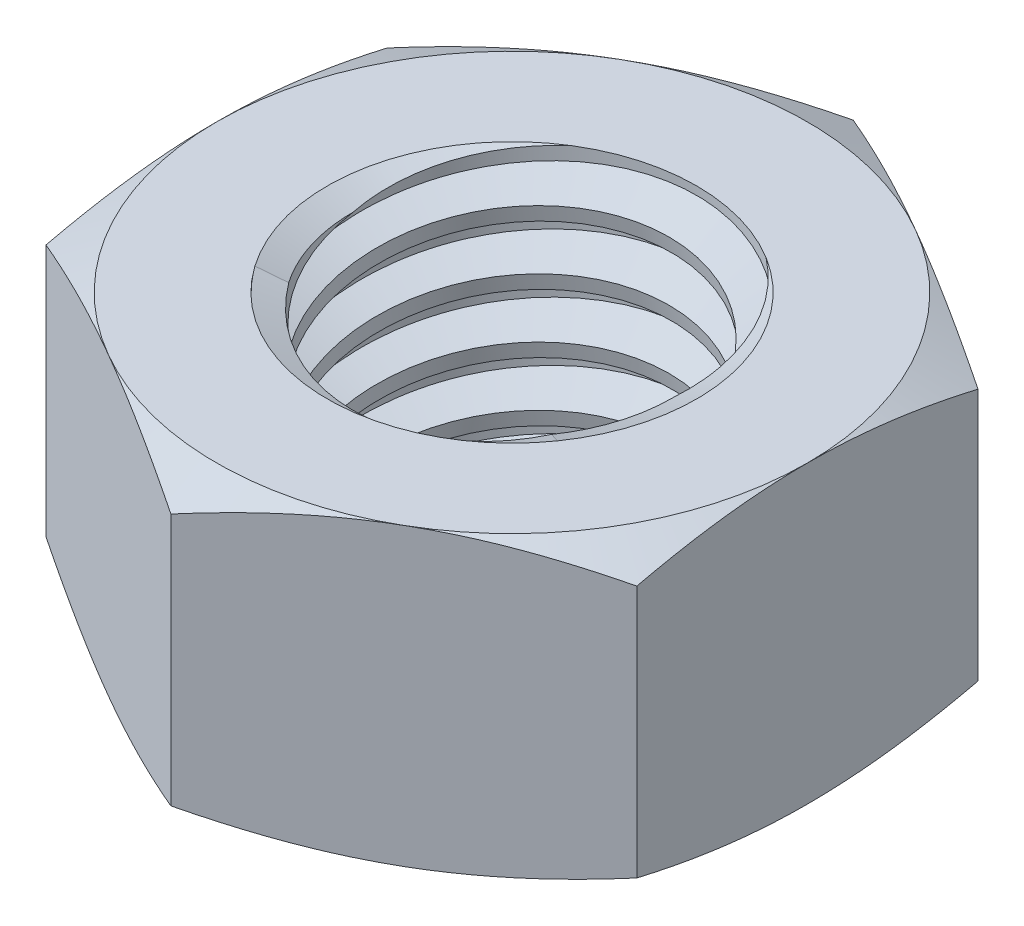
from build123d import *

# Parameters (mm, degrees)
EXTRUDE1_DEPTH      = 2
SKETCH2_W           = 2.5
SKETCH2_H           = 4
LPATTERN1_COUNT     = 5
LPATTERN1_PITCH     = 0.8
LPATTERN1_COL_COUNT = 2
LPATTERN1_COL_PITCH = 0.8


with BuildPart() as part:
    # Sketch1 → Extrude1 (new, symmetric)
    with BuildSketch(Plane(origin=(0, 0, 0), x_dir=(1, 0, 0), z_dir=(0, 1, 0))):
        Polygon((0, 4.618802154), (-4, 2.309401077), (-4, -2.309401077), (0, -4.618802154), (4, -2.309401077), (4, 2.309401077), align=None)
    extrude(amount=EXTRUDE1_DEPTH, both=True)

    # Sketch4 → Cut-Revolve2 (revolve, cut)
    with BuildSketch(Plane(origin=(0, 0, 0), x_dir=(0, 0, -1), z_dir=(1, 0, 0))):
        Polygon((0, 2), (2.5, 2), (2.127722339, 1.826404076), (2.127722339, -1.826404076), (2.5, -2), (0, -2), align=None)
    revolve(axis=Axis((0, 2, 0), (0, 1, 0)), mode=Mode.SUBTRACT)


with BuildPart() as body_2:
    # Sketch2 → Revolve1 (revolve)
    with BuildSketch(Plane(origin=(0, 0, 0), x_dir=(0, 0, -1), z_dir=(1, 0, 0))):
        with Locations((1.25, 0)):
            Rectangle(SKETCH2_W, SKETCH2_H)
    revolve(axis=Axis((0, -4.5, 0), (0, 1, 0)))

    # Sketch3 → Cut-Revolve1 (revolve, cut)
    with BuildSketch(Plane(origin=(0, 0, 0), x_dir=(0, 0, -1), z_dir=(1, 0, 0)), mode=Mode.PRIVATE) as cut_revolve1_sk:
        Polygon((2.51579905, 1.901255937), (2.626392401, 1.210047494), (2.15932044, 1.388495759), (2.127722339, 1.585983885), align=None)
    cut_revolve1 = revolve(cut_revolve1_sk.sketch.rotate(Axis((0, 2, 0.136915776), (0, -0.9874406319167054, -0.15799050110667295)), 180), axis=Axis((0, 2, 0.136915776), (0, -0.9874406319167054, -0.15799050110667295)), mode=Mode.SUBTRACT)

    # LPattern1: Cut-Revolve1 ×5
    with Locations(*[(0, -i * LPATTERN1_PITCH, 0) for i in range(1, LPATTERN1_COUNT)]):
        add(cut_revolve1, mode=Mode.SUBTRACT)

    # LPattern1 col: Cut-Revolve1 ×2
    with Locations(*[(0, i * LPATTERN1_COL_PITCH, 0) for i in range(1, LPATTERN1_COL_COUNT)]):
        add(cut_revolve1, mode=Mode.SUBTRACT)


with BuildPart() as part_1:
    add(part.part)

    # Combine1: cut body 2
    add(body_2.part, mode=Mode.SUBTRACT)

    # Sketch5 → Cut-Revolve3 (revolve, cut)
    with BuildSketch(Plane(origin=(0, 0, 0), x_dir=(0, 0, -1), z_dir=(1, 0, 0)), mode=Mode.PRIVATE) as cut_revolve3_sk:
        Polygon((0, -2), (4, -2), (4.618802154, -1.711447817), (4.618802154, 1.711447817), (4, 2), (0, 2), (0, 3.27), (5.888802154, 3.27), (5.888802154, -3.27), (0, -3.27), align=None)
    revolve(cut_revolve3_sk.sketch.rotate(Axis((0, -2, 0), (0, 1, 0)), 55.091745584), axis=Axis((0, -2, 0), (0, 1, 0)), mode=Mode.SUBTRACT)


solid = part_1.part
